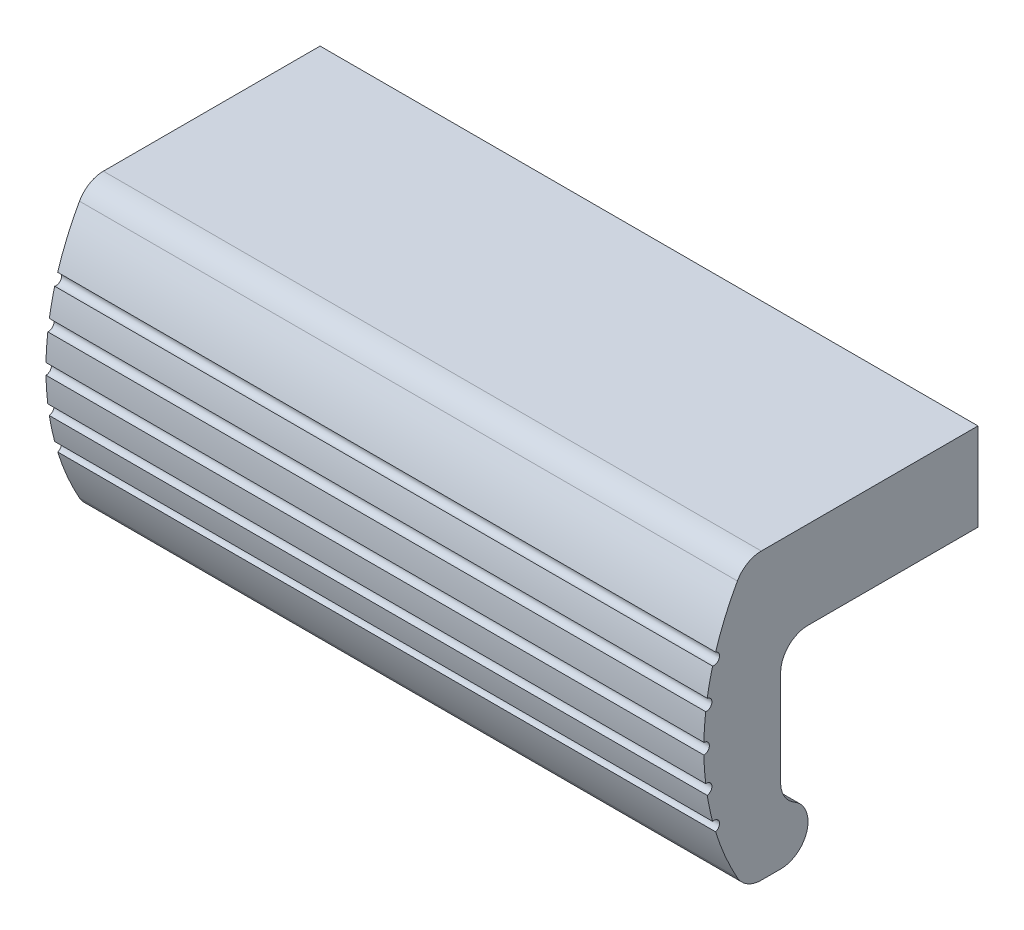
ISO-10303-21;
HEADER;
FILE_DESCRIPTION(('STEP AP214'),'2;1');
FILE_NAME('part.step','',(''),(''),'','','');
FILE_SCHEMA(('AUTOMOTIVE_DESIGN { 1 0 10303 214 1 1 1 1 }'));
ENDSEC;
DATA;
#1=APPLICATION_CONTEXT('core data for automotive mechanical design processes');
#2=APPLICATION_PROTOCOL_DEFINITION('international standard','automotive_design',2000,#1);
#3=PRODUCT_CONTEXT('',#1,'mechanical');
#4=PRODUCT('Part','Part','',(#3));
#5=PRODUCT_RELATED_PRODUCT_CATEGORY('part','',(#4));
#6=PRODUCT_DEFINITION_FORMATION('','',#4);
#7=PRODUCT_DEFINITION_CONTEXT('part definition',#1,'design');
#8=PRODUCT_DEFINITION('design','',#6,#7);
#9=PRODUCT_DEFINITION_SHAPE('','',#8);
#10=(LENGTH_UNIT() NAMED_UNIT(*) SI_UNIT(.MILLI.,.METRE.));
#11=(NAMED_UNIT(*) PLANE_ANGLE_UNIT() SI_UNIT($,.RADIAN.));
#12=(NAMED_UNIT(*) SI_UNIT($,.STERADIAN.) SOLID_ANGLE_UNIT());
#13=UNCERTAINTY_MEASURE_WITH_UNIT(LENGTH_MEASURE(1.E-05),#10,'distance_accuracy_value','');
#14=(GEOMETRIC_REPRESENTATION_CONTEXT(3) GLOBAL_UNCERTAINTY_ASSIGNED_CONTEXT((#13)) GLOBAL_UNIT_ASSIGNED_CONTEXT((#10,
#11,#12)) REPRESENTATION_CONTEXT('',''));
#15=CARTESIAN_POINT('',(0.,0.,0.));
#16=DIRECTION('',(0.,0.,1.));
#17=DIRECTION('',(1.,0.,0.));
#18=AXIS2_PLACEMENT_3D('',#15,#16,#17);
#19=CARTESIAN_POINT('',(-7.5,-4.,0.));
#20=DIRECTION('',(0.,1.,0.));
#21=DIRECTION('',(-1.,0.,0.));
#22=AXIS2_PLACEMENT_3D('',#19,#20,#21);
#23=PLANE('',#22);
#24=DIRECTION('',(1.,0.,0.));
#25=VECTOR('',#24,1.);
#26=CARTESIAN_POINT('',(-7.5,-4.,15.5));
#27=LINE('',#26,#25);
#28=CARTESIAN_POINT('',(-7.5,-4.,15.5));
#29=VERTEX_POINT('',#28);
#30=CARTESIAN_POINT('',(52.5,-4.,15.5));
#31=VERTEX_POINT('',#30);
#32=EDGE_CURVE('E9',#29,#31,#27,.T.);
#33=ORIENTED_EDGE('',*,*,#32,.F.);
#34=DIRECTION('',(0.,0.,1.));
#35=VECTOR('',#34,1.);
#36=CARTESIAN_POINT('',(-7.5,-4.,0.));
#37=LINE('',#36,#35);
#38=CARTESIAN_POINT('',(-7.5,-4.,0.));
#39=VERTEX_POINT('',#38);
#40=EDGE_CURVE('E232',#39,#29,#37,.T.);
#41=ORIENTED_EDGE('',*,*,#40,.F.);
#42=DIRECTION('',(1.,0.,0.));
#43=VECTOR('',#42,1.);
#44=CARTESIAN_POINT('',(-7.5,-4.,0.));
#45=LINE('',#44,#43);
#46=CARTESIAN_POINT('',(52.5,-4.,0.));
#47=VERTEX_POINT('',#46);
#48=EDGE_CURVE('E29',#39,#47,#45,.T.);
#49=ORIENTED_EDGE('',*,*,#48,.T.);
#50=DIRECTION('',(0.,0.,1.));
#51=VECTOR('',#50,1.);
#52=CARTESIAN_POINT('',(52.5,-4.,0.));
#53=LINE('',#52,#51);
#54=EDGE_CURVE('E167',#47,#31,#53,.T.);
#55=ORIENTED_EDGE('',*,*,#54,.T.);
#56=EDGE_LOOP('',(#33,#41,#49,#55));
#57=FACE_BOUND('',#56,.T.);
#58=ADVANCED_FACE('F14',(#57),#23,.F.);
#59=CARTESIAN_POINT('',(-7.5,-6.5,15.5));
#60=DIRECTION('',(1.,0.,0.));
#61=DIRECTION('',(0.,0.,-1.));
#62=AXIS2_PLACEMENT_3D('',#59,#60,#61);
#63=CYLINDRICAL_SURFACE('',#62,2.5);
#64=DIRECTION('',(1.,0.,0.));
#65=VECTOR('',#64,1.);
#66=CARTESIAN_POINT('',(-7.5,-6.5,18.));
#67=LINE('',#66,#65);
#68=CARTESIAN_POINT('',(-7.5,-6.5,18.));
#69=VERTEX_POINT('',#68);
#70=CARTESIAN_POINT('',(52.5,-6.5,18.));
#71=VERTEX_POINT('',#70);
#72=EDGE_CURVE('E22',#69,#71,#67,.T.);
#73=ORIENTED_EDGE('',*,*,#72,.F.);
#74=CARTESIAN_POINT('',(-7.5,-6.5,15.5));
#75=DIRECTION('',(-1.,0.,0.));
#76=DIRECTION('',(0.,0.,1.));
#77=AXIS2_PLACEMENT_3D('',#74,#75,#76);
#78=CIRCLE('',#77,2.5);
#79=EDGE_CURVE('E163',#69,#29,#78,.T.);
#80=ORIENTED_EDGE('',*,*,#79,.T.);
#81=ORIENTED_EDGE('',*,*,#32,.T.);
#82=CARTESIAN_POINT('',(52.5,-6.5,15.5));
#83=DIRECTION('',(-1.,0.,0.));
#84=DIRECTION('',(0.,0.,1.));
#85=AXIS2_PLACEMENT_3D('',#82,#83,#84);
#86=CIRCLE('',#85,2.5);
#87=EDGE_CURVE('E160',#71,#31,#86,.T.);
#88=ORIENTED_EDGE('',*,*,#87,.F.);
#89=EDGE_LOOP('',(#73,#80,#81,#88));
#90=FACE_BOUND('',#89,.T.);
#91=ADVANCED_FACE('F16',(#90),#63,.F.);
#92=CARTESIAN_POINT('',(-7.5,-6.5,18.));
#93=DIRECTION('',(0.,0.,1.));
#94=DIRECTION('',(1.,0.,0.));
#95=AXIS2_PLACEMENT_3D('',#92,#93,#94);
#96=PLANE('',#95);
#97=DIRECTION('',(1.,0.,0.));
#98=VECTOR('',#97,1.);
#99=CARTESIAN_POINT('',(-7.5,-15.1698729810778,18.));
#100=LINE('',#99,#98);
#101=CARTESIAN_POINT('',(-7.5,-15.1698729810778,18.));
#102=VERTEX_POINT('',#101);
#103=CARTESIAN_POINT('',(52.5,-15.1698729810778,18.));
#104=VERTEX_POINT('',#103);
#105=EDGE_CURVE('E324',#102,#104,#100,.T.);
#106=ORIENTED_EDGE('',*,*,#105,.F.);
#107=DIRECTION('',(0.,-1.,0.));
#108=VECTOR('',#107,1.);
#109=CARTESIAN_POINT('',(-7.5,-6.5,18.));
#110=LINE('',#109,#108);
#111=EDGE_CURVE('E235',#69,#102,#110,.T.);
#112=ORIENTED_EDGE('',*,*,#111,.F.);
#113=ORIENTED_EDGE('',*,*,#72,.T.);
#114=DIRECTION('',(0.,-1.,0.));
#115=VECTOR('',#114,1.);
#116=CARTESIAN_POINT('',(52.5,-6.5,18.));
#117=LINE('',#116,#115);
#118=EDGE_CURVE('E175',#71,#104,#117,.T.);
#119=ORIENTED_EDGE('',*,*,#118,.T.);
#120=EDGE_LOOP('',(#106,#112,#113,#119));
#121=FACE_BOUND('',#120,.T.);
#122=ADVANCED_FACE('F327',(#121),#96,.F.);
#123=CARTESIAN_POINT('',(-7.5,-15.1698729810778,15.5));
#124=DIRECTION('',(1.,0.,0.));
#125=DIRECTION('',(0.,0.,-1.));
#126=AXIS2_PLACEMENT_3D('',#123,#124,#125);
#127=CYLINDRICAL_SURFACE('',#126,2.5);
#128=DIRECTION('',(1.,0.,0.));
#129=VECTOR('',#128,1.);
#130=CARTESIAN_POINT('',(-7.5,-17.334936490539,16.75));
#131=LINE('',#130,#129);
#132=CARTESIAN_POINT('',(-7.5,-17.334936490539,16.75));
#133=VERTEX_POINT('',#132);
#134=CARTESIAN_POINT('',(52.5,-17.334936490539,16.75));
#135=VERTEX_POINT('',#134);
#136=EDGE_CURVE('E322',#133,#135,#131,.T.);
#137=ORIENTED_EDGE('',*,*,#136,.F.);
#138=CARTESIAN_POINT('',(-7.5,-15.1698729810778,15.5));
#139=DIRECTION('',(-1.,0.,0.));
#140=DIRECTION('',(0.,0.,1.));
#141=AXIS2_PLACEMENT_3D('',#138,#139,#140);
#142=CIRCLE('',#141,2.5);
#143=EDGE_CURVE('E238',#133,#102,#142,.T.);
#144=ORIENTED_EDGE('',*,*,#143,.T.);
#145=ORIENTED_EDGE('',*,*,#105,.T.);
#146=CARTESIAN_POINT('',(52.5,-15.1698729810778,15.5));
#147=DIRECTION('',(-1.,0.,0.));
#148=DIRECTION('',(0.,0.,1.));
#149=AXIS2_PLACEMENT_3D('',#146,#147,#148);
#150=CIRCLE('',#149,2.5);
#151=EDGE_CURVE('E177',#135,#104,#150,.T.);
#152=ORIENTED_EDGE('',*,*,#151,.F.);
#153=EDGE_LOOP('',(#137,#144,#145,#152));
#154=FACE_BOUND('',#153,.T.);
#155=ADVANCED_FACE('F396',(#154),#127,.F.);
#156=CARTESIAN_POINT('',(-7.5,-19.5,18.));
#157=DIRECTION('',(1.,0.,0.));
#158=DIRECTION('',(0.,0.,-1.));
#159=AXIS2_PLACEMENT_3D('',#156,#157,#158);
#160=CYLINDRICAL_SURFACE('',#159,2.5);
#161=DIRECTION('',(1.,0.,0.));
#162=VECTOR('',#161,1.);
#163=CARTESIAN_POINT('',(-7.5,-22.,18.));
#164=LINE('',#163,#162);
#165=CARTESIAN_POINT('',(-7.5,-22.,18.));
#166=VERTEX_POINT('',#165);
#167=CARTESIAN_POINT('',(52.5,-22.,18.));
#168=VERTEX_POINT('',#167);
#169=EDGE_CURVE('E320',#166,#168,#164,.T.);
#170=ORIENTED_EDGE('',*,*,#169,.F.);
#171=CARTESIAN_POINT('',(-7.5,-19.5,18.));
#172=DIRECTION('',(-1.,0.,0.));
#173=DIRECTION('',(0.,0.,1.));
#174=AXIS2_PLACEMENT_3D('',#171,#172,#173);
#175=CIRCLE('',#174,2.5);
#176=EDGE_CURVE('E241',#133,#166,#175,.T.);
#177=ORIENTED_EDGE('',*,*,#176,.F.);
#178=ORIENTED_EDGE('',*,*,#136,.T.);
#179=CARTESIAN_POINT('',(52.5,-19.5,18.));
#180=DIRECTION('',(-1.,0.,0.));
#181=DIRECTION('',(0.,0.,1.));
#182=AXIS2_PLACEMENT_3D('',#179,#180,#181);
#183=CIRCLE('',#182,2.5);
#184=EDGE_CURVE('E182',#135,#168,#183,.T.);
#185=ORIENTED_EDGE('',*,*,#184,.T.);
#186=EDGE_LOOP('',(#170,#177,#178,#185));
#187=FACE_BOUND('',#186,.T.);
#188=ADVANCED_FACE('F393',(#187),#160,.T.);
#189=CARTESIAN_POINT('',(-7.5,-22.,18.));
#190=DIRECTION('',(0.,1.,0.));
#191=DIRECTION('',(-1.,0.,0.));
#192=AXIS2_PLACEMENT_3D('',#189,#190,#191);
#193=PLANE('',#192);
#194=DIRECTION('',(1.,0.,0.));
#195=VECTOR('',#194,1.);
#196=CARTESIAN_POINT('',(-7.5,-22.,19.7616630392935));
#197=LINE('',#196,#195);
#198=CARTESIAN_POINT('',(-7.5,-22.,19.7616630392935));
#199=VERTEX_POINT('',#198);
#200=CARTESIAN_POINT('',(52.5,-22.,19.7616630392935));
#201=VERTEX_POINT('',#200);
#202=EDGE_CURVE('E318',#199,#201,#197,.T.);
#203=ORIENTED_EDGE('',*,*,#202,.F.);
#204=DIRECTION('',(0.,0.,1.));
#205=VECTOR('',#204,1.);
#206=CARTESIAN_POINT('',(-7.5,-22.,18.));
#207=LINE('',#206,#205);
#208=EDGE_CURVE('E244',#166,#199,#207,.T.);
#209=ORIENTED_EDGE('',*,*,#208,.F.);
#210=ORIENTED_EDGE('',*,*,#169,.T.);
#211=DIRECTION('',(0.,0.,1.));
#212=VECTOR('',#211,1.);
#213=CARTESIAN_POINT('',(52.5,-22.,18.));
#214=LINE('',#213,#212);
#215=EDGE_CURVE('E185',#168,#201,#214,.T.);
#216=ORIENTED_EDGE('',*,*,#215,.T.);
#217=EDGE_LOOP('',(#203,#209,#210,#216));
#218=FACE_BOUND('',#217,.T.);
#219=ADVANCED_FACE('F390',(#218),#193,.F.);
#220=CARTESIAN_POINT('',(-7.5,-19.5,19.7616630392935));
#221=DIRECTION('',(1.,0.,0.));
#222=DIRECTION('',(0.,0.,-1.));
#223=AXIS2_PLACEMENT_3D('',#220,#221,#222);
#224=CYLINDRICAL_SURFACE('',#223,2.5);
#225=DIRECTION('',(1.,0.,0.));
#226=VECTOR('',#225,1.);
#227=CARTESIAN_POINT('',(-7.5,-20.720930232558,21.943251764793));
#228=LINE('',#227,#226);
#229=CARTESIAN_POINT('',(-7.5,-20.720930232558,21.943251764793));
#230=VERTEX_POINT('',#229);
#231=CARTESIAN_POINT('',(52.5,-20.720930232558,21.943251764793));
#232=VERTEX_POINT('',#231);
#233=EDGE_CURVE('E316',#230,#232,#228,.T.);
#234=ORIENTED_EDGE('',*,*,#233,.F.);
#235=CARTESIAN_POINT('',(-7.5,-19.5,19.7616630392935));
#236=DIRECTION('',(-1.,0.,0.));
#237=DIRECTION('',(0.,0.,1.));
#238=AXIS2_PLACEMENT_3D('',#235,#236,#237);
#239=CIRCLE('',#238,2.5);
#240=EDGE_CURVE('E247',#199,#230,#239,.T.);
#241=ORIENTED_EDGE('',*,*,#240,.F.);
#242=ORIENTED_EDGE('',*,*,#202,.T.);
#243=CARTESIAN_POINT('',(52.5,-19.5,19.7616630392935));
#244=DIRECTION('',(-1.,0.,0.));
#245=DIRECTION('',(0.,0.,1.));
#246=AXIS2_PLACEMENT_3D('',#243,#244,#245);
#247=CIRCLE('',#246,2.5);
#248=EDGE_CURVE('E188',#201,#232,#247,.T.);
#249=ORIENTED_EDGE('',*,*,#248,.T.);
#250=EDGE_LOOP('',(#234,#241,#242,#249));
#251=FACE_BOUND('',#250,.T.);
#252=ADVANCED_FACE('F386',(#251),#224,.T.);
#253=CARTESIAN_POINT('',(-7.5,-9.,1.));
#254=DIRECTION('',(1.,0.,0.));
#255=DIRECTION('',(0.,0.,-1.));
#256=AXIS2_PLACEMENT_3D('',#253,#254,#255);
#257=CYLINDRICAL_SURFACE('',#256,24.);
#258=DIRECTION('',(1.,0.,0.));
#259=VECTOR('',#258,1.);
#260=CARTESIAN_POINT('',(-7.5,-16.094465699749,23.9274629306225));
#261=LINE('',#260,#259);
#262=CARTESIAN_POINT('',(-7.5,-16.094465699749,23.9274629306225));
#263=VERTEX_POINT('',#262);
#264=CARTESIAN_POINT('',(52.5,-16.094465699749,23.9274629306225));
#265=VERTEX_POINT('',#264);
#266=EDGE_CURVE('E314',#263,#265,#261,.T.);
#267=ORIENTED_EDGE('',*,*,#266,.F.);
#268=CARTESIAN_POINT('',(-7.5,-9.,1.));
#269=DIRECTION('',(-1.,0.,0.));
#270=DIRECTION('',(0.,0.,1.));
#271=AXIS2_PLACEMENT_3D('',#268,#269,#270);
#272=CIRCLE('',#271,24.);
#273=EDGE_CURVE('E250',#230,#263,#272,.T.);
#274=ORIENTED_EDGE('',*,*,#273,.F.);
#275=ORIENTED_EDGE('',*,*,#233,.T.);
#276=CARTESIAN_POINT('',(52.5,-9.,1.));
#277=DIRECTION('',(-1.,0.,0.));
#278=DIRECTION('',(0.,0.,1.));
#279=AXIS2_PLACEMENT_3D('',#276,#277,#278);
#280=CIRCLE('',#279,24.);
#281=EDGE_CURVE('E191',#232,#265,#280,.T.);
#282=ORIENTED_EDGE('',*,*,#281,.T.);
#283=EDGE_LOOP('',(#267,#274,#275,#282));
#284=FACE_BOUND('',#283,.T.);
#285=ADVANCED_FACE('F381',(#284),#257,.T.);
#286=CARTESIAN_POINT('',(-7.5,-15.615296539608,24.0702807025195));
#287=DIRECTION('',(1.,0.,0.));
#288=DIRECTION('',(0.,0.,-1.));
#289=AXIS2_PLACEMENT_3D('',#286,#287,#288);
#290=CYLINDRICAL_SURFACE('',#289,0.5);
#291=DIRECTION('',(1.,0.,0.));
#292=VECTOR('',#291,1.);
#293=CARTESIAN_POINT('',(-7.5,-15.1332561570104,24.2030853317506));
#294=LINE('',#293,#292);
#295=CARTESIAN_POINT('',(-7.5,-15.1332561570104,24.2030853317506));
#296=VERTEX_POINT('',#295);
#297=CARTESIAN_POINT('',(52.5,-15.1332561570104,24.2030853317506));
#298=VERTEX_POINT('',#297);
#299=EDGE_CURVE('E312',#296,#298,#294,.T.);
#300=ORIENTED_EDGE('',*,*,#299,.F.);
#301=CARTESIAN_POINT('',(-7.5,-15.615296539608,24.0702807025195));
#302=DIRECTION('',(-1.,0.,0.));
#303=DIRECTION('',(0.,0.,1.));
#304=AXIS2_PLACEMENT_3D('',#301,#302,#303);
#305=CIRCLE('',#304,0.5);
#306=EDGE_CURVE('E253',#296,#263,#305,.T.);
#307=ORIENTED_EDGE('',*,*,#306,.T.);
#308=ORIENTED_EDGE('',*,*,#266,.T.);
#309=CARTESIAN_POINT('',(52.5,-15.615296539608,24.0702807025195));
#310=DIRECTION('',(-1.,0.,0.));
#311=DIRECTION('',(0.,0.,1.));
#312=AXIS2_PLACEMENT_3D('',#309,#310,#311);
#313=CIRCLE('',#312,0.5);
#314=EDGE_CURVE('E194',#298,#265,#313,.T.);
#315=ORIENTED_EDGE('',*,*,#314,.F.);
#316=EDGE_LOOP('',(#300,#307,#308,#315));
#317=FACE_BOUND('',#316,.T.);
#318=ADVANCED_FACE('F378',(#317),#290,.F.);
#319=CARTESIAN_POINT('',(-7.5,-9.,1.));
#320=DIRECTION('',(1.,0.,0.));
#321=DIRECTION('',(0.,0.,-1.));
#322=AXIS2_PLACEMENT_3D('',#319,#320,#321);
#323=CYLINDRICAL_SURFACE('',#322,24.);
#324=DIRECTION('',(1.,0.,0.));
#325=VECTOR('',#324,1.);
#326=CARTESIAN_POINT('',(-7.5,-12.8345367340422,24.6916932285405));
#327=LINE('',#326,#325);
#328=CARTESIAN_POINT('',(-7.5,-12.8345367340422,24.6916932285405));
#329=VERTEX_POINT('',#328);
#330=CARTESIAN_POINT('',(52.5,-12.8345367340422,24.6916932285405));
#331=VERTEX_POINT('',#330);
#332=EDGE_CURVE('E310',#329,#331,#327,.T.);
#333=ORIENTED_EDGE('',*,*,#332,.F.);
#334=CARTESIAN_POINT('',(-7.5,-9.,1.));
#335=DIRECTION('',(-1.,0.,0.));
#336=DIRECTION('',(0.,0.,1.));
#337=AXIS2_PLACEMENT_3D('',#334,#335,#336);
#338=CIRCLE('',#337,24.);
#339=EDGE_CURVE('E256',#296,#329,#338,.T.);
#340=ORIENTED_EDGE('',*,*,#339,.F.);
#341=ORIENTED_EDGE('',*,*,#299,.T.);
#342=CARTESIAN_POINT('',(52.5,-9.,1.));
#343=DIRECTION('',(-1.,0.,0.));
#344=DIRECTION('',(0.,0.,1.));
#345=AXIS2_PLACEMENT_3D('',#342,#343,#344);
#346=CIRCLE('',#345,24.);
#347=EDGE_CURVE('E197',#298,#331,#346,.T.);
#348=ORIENTED_EDGE('',*,*,#347,.T.);
#349=EDGE_LOOP('',(#333,#340,#341,#348));
#350=FACE_BOUND('',#349,.T.);
#351=ADVANCED_FACE('F374',(#350),#323,.T.);
#352=CARTESIAN_POINT('',(-7.5,-12.3401544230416,24.7664336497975));
#353=DIRECTION('',(1.,0.,0.));
#354=DIRECTION('',(0.,0.,-1.));
#355=AXIS2_PLACEMENT_3D('',#352,#353,#354);
#356=CYLINDRICAL_SURFACE('',#355,0.5);
#357=DIRECTION('',(1.,0.,0.));
#358=VECTOR('',#357,1.);
#359=CARTESIAN_POINT('',(-7.5,-11.8443223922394,24.830858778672));
#360=LINE('',#359,#358);
#361=CARTESIAN_POINT('',(-7.5,-11.8443223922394,24.830858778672));
#362=VERTEX_POINT('',#361);
#363=CARTESIAN_POINT('',(52.5,-11.8443223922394,24.830858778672));
#364=VERTEX_POINT('',#363);
#365=EDGE_CURVE('E308',#362,#364,#360,.T.);
#366=ORIENTED_EDGE('',*,*,#365,.F.);
#367=CARTESIAN_POINT('',(-7.5,-12.3401544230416,24.7664336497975));
#368=DIRECTION('',(-1.,0.,0.));
#369=DIRECTION('',(0.,0.,1.));
#370=AXIS2_PLACEMENT_3D('',#367,#368,#369);
#371=CIRCLE('',#370,0.5);
#372=EDGE_CURVE('E259',#362,#329,#371,.T.);
#373=ORIENTED_EDGE('',*,*,#372,.T.);
#374=ORIENTED_EDGE('',*,*,#332,.T.);
#375=CARTESIAN_POINT('',(52.5,-12.3401544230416,24.7664336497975));
#376=DIRECTION('',(-1.,0.,0.));
#377=DIRECTION('',(0.,0.,1.));
#378=AXIS2_PLACEMENT_3D('',#375,#376,#377);
#379=CIRCLE('',#378,0.5);
#380=EDGE_CURVE('E200',#364,#331,#379,.T.);
#381=ORIENTED_EDGE('',*,*,#380,.F.);
#382=EDGE_LOOP('',(#366,#373,#374,#381));
#383=FACE_BOUND('',#382,.T.);
#384=ADVANCED_FACE('F369',(#383),#356,.F.);
#385=CARTESIAN_POINT('',(-7.5,-9.,1.));
#386=DIRECTION('',(1.,0.,0.));
#387=DIRECTION('',(0.,0.,-1.));
#388=AXIS2_PLACEMENT_3D('',#385,#386,#387);
#389=CYLINDRICAL_SURFACE('',#388,24.);
#390=DIRECTION('',(1.,0.,0.));
#391=VECTOR('',#390,1.);
#392=CARTESIAN_POINT('',(-7.5,-9.49997287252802,24.9947916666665));
#393=LINE('',#392,#391);
#394=CARTESIAN_POINT('',(-7.5,-9.49997287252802,24.9947916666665));
#395=VERTEX_POINT('',#394);
#396=CARTESIAN_POINT('',(52.5,-9.49997287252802,24.9947916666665));
#397=VERTEX_POINT('',#396);
#398=EDGE_CURVE('E306',#395,#397,#393,.T.);
#399=ORIENTED_EDGE('',*,*,#398,.F.);
#400=CARTESIAN_POINT('',(-7.5,-9.,1.));
#401=DIRECTION('',(-1.,0.,0.));
#402=DIRECTION('',(0.,0.,1.));
#403=AXIS2_PLACEMENT_3D('',#400,#401,#402);
#404=CIRCLE('',#403,24.);
#405=EDGE_CURVE('E262',#362,#395,#404,.T.);
#406=ORIENTED_EDGE('',*,*,#405,.F.);
#407=ORIENTED_EDGE('',*,*,#365,.T.);
#408=CARTESIAN_POINT('',(52.5,-9.,1.));
#409=DIRECTION('',(-1.,0.,0.));
#410=DIRECTION('',(0.,0.,1.));
#411=AXIS2_PLACEMENT_3D('',#408,#409,#410);
#412=CIRCLE('',#411,24.);
#413=EDGE_CURVE('E203',#364,#397,#412,.T.);
#414=ORIENTED_EDGE('',*,*,#413,.T.);
#415=EDGE_LOOP('',(#399,#406,#407,#414));
#416=FACE_BOUND('',#415,.T.);
#417=ADVANCED_FACE('F365',(#416),#389,.T.);
#418=CARTESIAN_POINT('',(-7.5,-9.,25.));
#419=DIRECTION('',(1.,0.,0.));
#420=DIRECTION('',(0.,0.,-1.));
#421=AXIS2_PLACEMENT_3D('',#418,#419,#420);
#422=CYLINDRICAL_SURFACE('',#421,0.500000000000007);
#423=DIRECTION('',(1.,0.,0.));
#424=VECTOR('',#423,1.);
#425=CARTESIAN_POINT('',(-7.5,-8.50002712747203,24.9947916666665));
#426=LINE('',#425,#424);
#427=CARTESIAN_POINT('',(-7.5,-8.50002712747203,24.9947916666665));
#428=VERTEX_POINT('',#427);
#429=CARTESIAN_POINT('',(52.5,-8.50002712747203,24.9947916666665));
#430=VERTEX_POINT('',#429);
#431=EDGE_CURVE('E304',#428,#430,#426,.T.);
#432=ORIENTED_EDGE('',*,*,#431,.F.);
#433=CARTESIAN_POINT('',(-7.5,-9.,25.));
#434=DIRECTION('',(-1.,0.,0.));
#435=DIRECTION('',(0.,0.,1.));
#436=AXIS2_PLACEMENT_3D('',#433,#434,#435);
#437=CIRCLE('',#436,0.500000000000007);
#438=EDGE_CURVE('E265',#428,#395,#437,.T.);
#439=ORIENTED_EDGE('',*,*,#438,.T.);
#440=ORIENTED_EDGE('',*,*,#398,.T.);
#441=CARTESIAN_POINT('',(52.5,-9.,25.));
#442=DIRECTION('',(-1.,0.,0.));
#443=DIRECTION('',(0.,0.,1.));
#444=AXIS2_PLACEMENT_3D('',#441,#442,#443);
#445=CIRCLE('',#444,0.500000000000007);
#446=EDGE_CURVE('E206',#430,#397,#445,.T.);
#447=ORIENTED_EDGE('',*,*,#446,.F.);
#448=EDGE_LOOP('',(#432,#439,#440,#447));
#449=FACE_BOUND('',#448,.T.);
#450=ADVANCED_FACE('F361',(#449),#422,.F.);
#451=CARTESIAN_POINT('',(-7.5,-9.,1.));
#452=DIRECTION('',(1.,0.,0.));
#453=DIRECTION('',(0.,0.,-1.));
#454=AXIS2_PLACEMENT_3D('',#451,#452,#453);
#455=CYLINDRICAL_SURFACE('',#454,24.);
#456=DIRECTION('',(1.,0.,0.));
#457=VECTOR('',#456,1.);
#458=CARTESIAN_POINT('',(-7.5,-6.15567760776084,24.830858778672));
#459=LINE('',#458,#457);
#460=CARTESIAN_POINT('',(-7.5,-6.15567760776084,24.830858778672));
#461=VERTEX_POINT('',#460);
#462=CARTESIAN_POINT('',(52.5,-6.15567760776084,24.830858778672));
#463=VERTEX_POINT('',#462);
#464=EDGE_CURVE('E302',#461,#463,#459,.T.);
#465=ORIENTED_EDGE('',*,*,#464,.F.);
#466=CARTESIAN_POINT('',(-7.5,-9.,1.));
#467=DIRECTION('',(-1.,0.,0.));
#468=DIRECTION('',(0.,0.,1.));
#469=AXIS2_PLACEMENT_3D('',#466,#467,#468);
#470=CIRCLE('',#469,24.);
#471=EDGE_CURVE('E268',#428,#461,#470,.T.);
#472=ORIENTED_EDGE('',*,*,#471,.F.);
#473=ORIENTED_EDGE('',*,*,#431,.T.);
#474=CARTESIAN_POINT('',(52.5,-9.,1.));
#475=DIRECTION('',(-1.,0.,0.));
#476=DIRECTION('',(0.,0.,1.));
#477=AXIS2_PLACEMENT_3D('',#474,#475,#476);
#478=CIRCLE('',#477,24.);
#479=EDGE_CURVE('E209',#430,#463,#478,.T.);
#480=ORIENTED_EDGE('',*,*,#479,.T.);
#481=EDGE_LOOP('',(#465,#472,#473,#480));
#482=FACE_BOUND('',#481,.T.);
#483=ADVANCED_FACE('F357',(#482),#455,.T.);
#484=CARTESIAN_POINT('',(-7.5,-5.65984557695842,24.7664336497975));
#485=DIRECTION('',(1.,0.,0.));
#486=DIRECTION('',(0.,0.,-1.));
#487=AXIS2_PLACEMENT_3D('',#484,#485,#486);
#488=CYLINDRICAL_SURFACE('',#487,0.499999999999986);
#489=DIRECTION('',(1.,0.,0.));
#490=VECTOR('',#489,1.);
#491=CARTESIAN_POINT('',(-7.5,-5.16546326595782,24.6916932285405));
#492=LINE('',#491,#490);
#493=CARTESIAN_POINT('',(-7.5,-5.16546326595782,24.6916932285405));
#494=VERTEX_POINT('',#493);
#495=CARTESIAN_POINT('',(52.5,-5.16546326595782,24.6916932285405));
#496=VERTEX_POINT('',#495);
#497=EDGE_CURVE('E300',#494,#496,#492,.T.);
#498=ORIENTED_EDGE('',*,*,#497,.F.);
#499=CARTESIAN_POINT('',(-7.5,-5.65984557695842,24.7664336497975));
#500=DIRECTION('',(-1.,0.,0.));
#501=DIRECTION('',(0.,0.,1.));
#502=AXIS2_PLACEMENT_3D('',#499,#500,#501);
#503=CIRCLE('',#502,0.499999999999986);
#504=EDGE_CURVE('E271',#494,#461,#503,.T.);
#505=ORIENTED_EDGE('',*,*,#504,.T.);
#506=ORIENTED_EDGE('',*,*,#464,.T.);
#507=CARTESIAN_POINT('',(52.5,-5.65984557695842,24.7664336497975));
#508=DIRECTION('',(-1.,0.,0.));
#509=DIRECTION('',(0.,0.,1.));
#510=AXIS2_PLACEMENT_3D('',#507,#508,#509);
#511=CIRCLE('',#510,0.499999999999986);
#512=EDGE_CURVE('E212',#496,#463,#511,.T.);
#513=ORIENTED_EDGE('',*,*,#512,.F.);
#514=EDGE_LOOP('',(#498,#505,#506,#513));
#515=FACE_BOUND('',#514,.T.);
#516=ADVANCED_FACE('F354',(#515),#488,.F.);
#517=CARTESIAN_POINT('',(-7.5,-9.,1.));
#518=DIRECTION('',(1.,0.,0.));
#519=DIRECTION('',(0.,0.,-1.));
#520=AXIS2_PLACEMENT_3D('',#517,#518,#519);
#521=CYLINDRICAL_SURFACE('',#520,24.);
#522=DIRECTION('',(1.,0.,0.));
#523=VECTOR('',#522,1.);
#524=CARTESIAN_POINT('',(-7.5,-2.8667438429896,24.2030853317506));
#525=LINE('',#524,#523);
#526=CARTESIAN_POINT('',(-7.5,-2.8667438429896,24.2030853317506));
#527=VERTEX_POINT('',#526);
#528=CARTESIAN_POINT('',(52.5,-2.8667438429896,24.2030853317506));
#529=VERTEX_POINT('',#528);
#530=EDGE_CURVE('E298',#527,#529,#525,.T.);
#531=ORIENTED_EDGE('',*,*,#530,.F.);
#532=CARTESIAN_POINT('',(-7.5,-9.,1.));
#533=DIRECTION('',(-1.,0.,0.));
#534=DIRECTION('',(0.,0.,1.));
#535=AXIS2_PLACEMENT_3D('',#532,#533,#534);
#536=CIRCLE('',#535,24.);
#537=EDGE_CURVE('E274',#494,#527,#536,.T.);
#538=ORIENTED_EDGE('',*,*,#537,.F.);
#539=ORIENTED_EDGE('',*,*,#497,.T.);
#540=CARTESIAN_POINT('',(52.5,-9.,1.));
#541=DIRECTION('',(-1.,0.,0.));
#542=DIRECTION('',(0.,0.,1.));
#543=AXIS2_PLACEMENT_3D('',#540,#541,#542);
#544=CIRCLE('',#543,24.);
#545=EDGE_CURVE('E215',#496,#529,#544,.T.);
#546=ORIENTED_EDGE('',*,*,#545,.T.);
#547=EDGE_LOOP('',(#531,#538,#539,#546));
#548=FACE_BOUND('',#547,.T.);
#549=ADVANCED_FACE('F350',(#548),#521,.T.);
#550=CARTESIAN_POINT('',(-7.5,-2.38470346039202,24.0702807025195));
#551=DIRECTION('',(1.,0.,0.));
#552=DIRECTION('',(0.,0.,-1.));
#553=AXIS2_PLACEMENT_3D('',#550,#551,#552);
#554=CYLINDRICAL_SURFACE('',#553,0.500000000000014);
#555=DIRECTION('',(1.,0.,0.));
#556=VECTOR('',#555,1.);
#557=CARTESIAN_POINT('',(-7.5,-1.90553430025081,23.9274629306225));
#558=LINE('',#557,#556);
#559=CARTESIAN_POINT('',(-7.5,-1.90553430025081,23.9274629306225));
#560=VERTEX_POINT('',#559);
#561=CARTESIAN_POINT('',(52.5,-1.90553430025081,23.9274629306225));
#562=VERTEX_POINT('',#561);
#563=EDGE_CURVE('E296',#560,#562,#558,.T.);
#564=ORIENTED_EDGE('',*,*,#563,.F.);
#565=CARTESIAN_POINT('',(-7.5,-2.38470346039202,24.0702807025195));
#566=DIRECTION('',(-1.,0.,0.));
#567=DIRECTION('',(0.,0.,1.));
#568=AXIS2_PLACEMENT_3D('',#565,#566,#567);
#569=CIRCLE('',#568,0.500000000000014);
#570=EDGE_CURVE('E277',#560,#527,#569,.T.);
#571=ORIENTED_EDGE('',*,*,#570,.T.);
#572=ORIENTED_EDGE('',*,*,#530,.T.);
#573=CARTESIAN_POINT('',(52.5,-2.38470346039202,24.0702807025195));
#574=DIRECTION('',(-1.,0.,0.));
#575=DIRECTION('',(0.,0.,1.));
#576=AXIS2_PLACEMENT_3D('',#573,#574,#575);
#577=CIRCLE('',#576,0.500000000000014);
#578=EDGE_CURVE('E218',#562,#529,#577,.T.);
#579=ORIENTED_EDGE('',*,*,#578,.F.);
#580=EDGE_LOOP('',(#564,#571,#572,#579));
#581=FACE_BOUND('',#580,.T.);
#582=ADVANCED_FACE('F345',(#581),#554,.F.);
#583=CARTESIAN_POINT('',(-7.5,-9.,1.));
#584=DIRECTION('',(1.,0.,0.));
#585=DIRECTION('',(0.,0.,-1.));
#586=AXIS2_PLACEMENT_3D('',#583,#584,#585);
#587=CYLINDRICAL_SURFACE('',#586,24.);
#588=DIRECTION('',(1.,0.,0.));
#589=VECTOR('',#588,1.);
#590=CARTESIAN_POINT('',(-7.5,2.72093023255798,21.943251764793));
#591=LINE('',#590,#589);
#592=CARTESIAN_POINT('',(-7.5,2.72093023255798,21.943251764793));
#593=VERTEX_POINT('',#592);
#594=CARTESIAN_POINT('',(52.5,2.72093023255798,21.943251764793));
#595=VERTEX_POINT('',#594);
#596=EDGE_CURVE('E294',#593,#595,#591,.T.);
#597=ORIENTED_EDGE('',*,*,#596,.F.);
#598=CARTESIAN_POINT('',(-7.5,-9.,1.));
#599=DIRECTION('',(-1.,0.,0.));
#600=DIRECTION('',(0.,0.,1.));
#601=AXIS2_PLACEMENT_3D('',#598,#599,#600);
#602=CIRCLE('',#601,24.);
#603=EDGE_CURVE('E280',#560,#593,#602,.T.);
#604=ORIENTED_EDGE('',*,*,#603,.F.);
#605=ORIENTED_EDGE('',*,*,#563,.T.);
#606=CARTESIAN_POINT('',(52.5,-9.,1.));
#607=DIRECTION('',(-1.,0.,0.));
#608=DIRECTION('',(0.,0.,1.));
#609=AXIS2_PLACEMENT_3D('',#606,#607,#608);
#610=CIRCLE('',#609,24.);
#611=EDGE_CURVE('E221',#562,#595,#610,.T.);
#612=ORIENTED_EDGE('',*,*,#611,.T.);
#613=EDGE_LOOP('',(#597,#604,#605,#612));
#614=FACE_BOUND('',#613,.T.);
#615=ADVANCED_FACE('F341',(#614),#587,.T.);
#616=CARTESIAN_POINT('',(-7.5,1.5,19.7616630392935));
#617=DIRECTION('',(1.,0.,0.));
#618=DIRECTION('',(0.,0.,-1.));
#619=AXIS2_PLACEMENT_3D('',#616,#617,#618);
#620=CYLINDRICAL_SURFACE('',#619,2.5);
#621=DIRECTION('',(1.,0.,0.));
#622=VECTOR('',#621,1.);
#623=CARTESIAN_POINT('',(-7.5,4.,19.7616630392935));
#624=LINE('',#623,#622);
#625=CARTESIAN_POINT('',(-7.5,4.,19.7616630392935));
#626=VERTEX_POINT('',#625);
#627=CARTESIAN_POINT('',(52.5,4.,19.7616630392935));
#628=VERTEX_POINT('',#627);
#629=EDGE_CURVE('E292',#626,#628,#624,.T.);
#630=ORIENTED_EDGE('',*,*,#629,.F.);
#631=CARTESIAN_POINT('',(-7.5,1.5,19.7616630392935));
#632=DIRECTION('',(-1.,0.,0.));
#633=DIRECTION('',(0.,0.,1.));
#634=AXIS2_PLACEMENT_3D('',#631,#632,#633);
#635=CIRCLE('',#634,2.5);
#636=EDGE_CURVE('E283',#593,#626,#635,.T.);
#637=ORIENTED_EDGE('',*,*,#636,.F.);
#638=ORIENTED_EDGE('',*,*,#596,.T.);
#639=CARTESIAN_POINT('',(52.5,1.5,19.7616630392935));
#640=DIRECTION('',(-1.,0.,0.));
#641=DIRECTION('',(0.,0.,1.));
#642=AXIS2_PLACEMENT_3D('',#639,#640,#641);
#643=CIRCLE('',#642,2.5);
#644=EDGE_CURVE('E224',#595,#628,#643,.T.);
#645=ORIENTED_EDGE('',*,*,#644,.T.);
#646=EDGE_LOOP('',(#630,#637,#638,#645));
#647=FACE_BOUND('',#646,.T.);
#648=ADVANCED_FACE('F337',(#647),#620,.T.);
#649=CARTESIAN_POINT('',(-7.5,4.,0.));
#650=DIRECTION('',(0.,1.,0.));
#651=DIRECTION('',(-1.,0.,0.));
#652=AXIS2_PLACEMENT_3D('',#649,#650,#651);
#653=PLANE('',#652);
#654=DIRECTION('',(1.,0.,0.));
#655=VECTOR('',#654,1.);
#656=CARTESIAN_POINT('',(-7.5,4.,0.));
#657=LINE('',#656,#655);
#658=CARTESIAN_POINT('',(-7.5,4.,0.));
#659=VERTEX_POINT('',#658);
#660=CARTESIAN_POINT('',(52.5,4.,0.));
#661=VERTEX_POINT('',#660);
#662=EDGE_CURVE('E37',#659,#661,#657,.T.);
#663=ORIENTED_EDGE('',*,*,#662,.F.);
#664=DIRECTION('',(0.,0.,1.));
#665=VECTOR('',#664,1.);
#666=CARTESIAN_POINT('',(-7.5,4.,0.));
#667=LINE('',#666,#665);
#668=EDGE_CURVE('E286',#659,#626,#667,.T.);
#669=ORIENTED_EDGE('',*,*,#668,.T.);
#670=ORIENTED_EDGE('',*,*,#629,.T.);
#671=DIRECTION('',(0.,0.,1.));
#672=VECTOR('',#671,1.);
#673=CARTESIAN_POINT('',(52.5,4.,0.));
#674=LINE('',#673,#672);
#675=EDGE_CURVE('E227',#661,#628,#674,.T.);
#676=ORIENTED_EDGE('',*,*,#675,.F.);
#677=EDGE_LOOP('',(#663,#669,#670,#676));
#678=FACE_BOUND('',#677,.T.);
#679=ADVANCED_FACE('F333',(#678),#653,.T.);
#680=CARTESIAN_POINT('',(-7.5,-4.,0.));
#681=DIRECTION('',(0.,0.,-1.));
#682=DIRECTION('',(-1.,0.,0.));
#683=AXIS2_PLACEMENT_3D('',#680,#681,#682);
#684=PLANE('',#683);
#685=CARTESIAN_POINT('',(0.,0.,0.));
#686=DIRECTION('',(0.,0.,-1.));
#687=DIRECTION('',(-1.,0.,0.));
#688=AXIS2_PLACEMENT_3D('',#685,#686,#687);
#689=CIRCLE('',#688,2.);
#690=CARTESIAN_POINT('',(-2.,0.,0.));
#691=VERTEX_POINT('',#690);
#692=EDGE_CURVE('E632',#691,#691,#689,.T.);
#693=ORIENTED_EDGE('',*,*,#692,.F.);
#694=EDGE_LOOP('',(#693));
#695=FACE_BOUND('',#694,.T.);
#696=CARTESIAN_POINT('',(45.,0.,0.));
#697=DIRECTION('',(0.,0.,-1.));
#698=DIRECTION('',(-1.,0.,0.));
#699=AXIS2_PLACEMENT_3D('',#696,#697,#698);
#700=CIRCLE('',#699,2.);
#701=CARTESIAN_POINT('',(43.,0.,0.));
#702=VERTEX_POINT('',#701);
#703=EDGE_CURVE('E631',#702,#702,#700,.T.);
#704=ORIENTED_EDGE('',*,*,#703,.F.);
#705=EDGE_LOOP('',(#704));
#706=FACE_BOUND('',#705,.T.);
#707=DIRECTION('',(0.,1.,0.));
#708=VECTOR('',#707,1.);
#709=CARTESIAN_POINT('',(-7.5,-4.,0.));
#710=LINE('',#709,#708);
#711=EDGE_CURVE('E288',#39,#659,#710,.T.);
#712=ORIENTED_EDGE('',*,*,#711,.T.);
#713=ORIENTED_EDGE('',*,*,#662,.T.);
#714=DIRECTION('',(0.,1.,0.));
#715=VECTOR('',#714,1.);
#716=CARTESIAN_POINT('',(52.5,-4.,0.));
#717=LINE('',#716,#715);
#718=EDGE_CURVE('E230',#47,#661,#717,.T.);
#719=ORIENTED_EDGE('',*,*,#718,.F.);
#720=ORIENTED_EDGE('',*,*,#48,.F.);
#721=EDGE_LOOP('',(#712,#713,#719,#720));
#722=FACE_BOUND('',#721,.T.);
#723=ADVANCED_FACE('F332',(#695,#706,#722),#684,.T.);
#724=CARTESIAN_POINT('',(-7.5,-6.5,15.5));
#725=DIRECTION('',(-1.,0.,0.));
#726=DIRECTION('',(0.,0.,1.));
#727=AXIS2_PLACEMENT_3D('',#724,#725,#726);
#728=PLANE('',#727);
#729=ORIENTED_EDGE('',*,*,#40,.T.);
#730=ORIENTED_EDGE('',*,*,#79,.F.);
#731=ORIENTED_EDGE('',*,*,#111,.T.);
#732=ORIENTED_EDGE('',*,*,#143,.F.);
#733=ORIENTED_EDGE('',*,*,#176,.T.);
#734=ORIENTED_EDGE('',*,*,#208,.T.);
#735=ORIENTED_EDGE('',*,*,#240,.T.);
#736=ORIENTED_EDGE('',*,*,#273,.T.);
#737=ORIENTED_EDGE('',*,*,#306,.F.);
#738=ORIENTED_EDGE('',*,*,#339,.T.);
#739=ORIENTED_EDGE('',*,*,#372,.F.);
#740=ORIENTED_EDGE('',*,*,#405,.T.);
#741=ORIENTED_EDGE('',*,*,#438,.F.);
#742=ORIENTED_EDGE('',*,*,#471,.T.);
#743=ORIENTED_EDGE('',*,*,#504,.F.);
#744=ORIENTED_EDGE('',*,*,#537,.T.);
#745=ORIENTED_EDGE('',*,*,#570,.F.);
#746=ORIENTED_EDGE('',*,*,#603,.T.);
#747=ORIENTED_EDGE('',*,*,#636,.T.);
#748=ORIENTED_EDGE('',*,*,#668,.F.);
#749=ORIENTED_EDGE('',*,*,#711,.F.);
#750=EDGE_LOOP('',(#729,#730,#731,#732,#733,#734,#735,#736,#737,#738,#739,#740,#741,#742,#743,
#744,#745,#746,#747,#748,#749));
#751=FACE_BOUND('',#750,.T.);
#752=ADVANCED_FACE('F329',(#751),#728,.T.);
#753=CARTESIAN_POINT('',(52.5,-6.5,15.5));
#754=DIRECTION('',(-1.,0.,0.));
#755=DIRECTION('',(0.,0.,1.));
#756=AXIS2_PLACEMENT_3D('',#753,#754,#755);
#757=PLANE('',#756);
#758=ORIENTED_EDGE('',*,*,#54,.F.);
#759=ORIENTED_EDGE('',*,*,#718,.T.);
#760=ORIENTED_EDGE('',*,*,#675,.T.);
#761=ORIENTED_EDGE('',*,*,#644,.F.);
#762=ORIENTED_EDGE('',*,*,#611,.F.);
#763=ORIENTED_EDGE('',*,*,#578,.T.);
#764=ORIENTED_EDGE('',*,*,#545,.F.);
#765=ORIENTED_EDGE('',*,*,#512,.T.);
#766=ORIENTED_EDGE('',*,*,#479,.F.);
#767=ORIENTED_EDGE('',*,*,#446,.T.);
#768=ORIENTED_EDGE('',*,*,#413,.F.);
#769=ORIENTED_EDGE('',*,*,#380,.T.);
#770=ORIENTED_EDGE('',*,*,#347,.F.);
#771=ORIENTED_EDGE('',*,*,#314,.T.);
#772=ORIENTED_EDGE('',*,*,#281,.F.);
#773=ORIENTED_EDGE('',*,*,#248,.F.);
#774=ORIENTED_EDGE('',*,*,#215,.F.);
#775=ORIENTED_EDGE('',*,*,#184,.F.);
#776=ORIENTED_EDGE('',*,*,#151,.T.);
#777=ORIENTED_EDGE('',*,*,#118,.F.);
#778=ORIENTED_EDGE('',*,*,#87,.T.);
#779=EDGE_LOOP('',(#758,#759,#760,#761,#762,#763,#764,#765,#766,#767,#768,#769,#770,#771,#772,
#773,#774,#775,#776,#777,#778));
#780=FACE_BOUND('',#779,.T.);
#781=ADVANCED_FACE('F172',(#780),#757,.F.);
#782=CARTESIAN_POINT('',(45.,0.,8.));
#783=DIRECTION('',(0.,0.,-1.));
#784=DIRECTION('',(-1.,0.,0.));
#785=AXIS2_PLACEMENT_3D('',#782,#783,#784);
#786=CYLINDRICAL_SURFACE('',#785,2.);
#787=CARTESIAN_POINT('',(45.,0.,8.));
#788=DIRECTION('',(0.,0.,-1.));
#789=DIRECTION('',(-1.,0.,0.));
#790=AXIS2_PLACEMENT_3D('',#787,#788,#789);
#791=CIRCLE('',#790,2.);
#792=CARTESIAN_POINT('',(43.,0.,8.));
#793=VERTEX_POINT('',#792);
#794=EDGE_CURVE('E170',#793,#793,#791,.T.);
#795=ORIENTED_EDGE('',*,*,#794,.F.);
#796=EDGE_LOOP('',(#795));
#797=FACE_BOUND('',#796,.T.);
#798=ORIENTED_EDGE('',*,*,#703,.T.);
#799=EDGE_LOOP('',(#798));
#800=FACE_BOUND('',#799,.T.);
#801=ADVANCED_FACE('F545',(#797,#800),#786,.F.);
#802=CARTESIAN_POINT('',(45.,0.,8.));
#803=DIRECTION('',(0.,0.,-1.));
#804=DIRECTION('',(-1.,0.,0.));
#805=AXIS2_PLACEMENT_3D('',#802,#803,#804);
#806=PLANE('',#805);
#807=ORIENTED_EDGE('',*,*,#794,.T.);
#808=EDGE_LOOP('',(#807));
#809=FACE_BOUND('',#808,.T.);
#810=ADVANCED_FACE('F546',(#809),#806,.T.);
#811=CARTESIAN_POINT('',(0.,0.,8.));
#812=DIRECTION('',(0.,0.,-1.));
#813=DIRECTION('',(-1.,0.,0.));
#814=AXIS2_PLACEMENT_3D('',#811,#812,#813);
#815=CYLINDRICAL_SURFACE('',#814,2.);
#816=CARTESIAN_POINT('',(0.,0.,8.));
#817=DIRECTION('',(0.,0.,-1.));
#818=DIRECTION('',(-1.,0.,0.));
#819=AXIS2_PLACEMENT_3D('',#816,#817,#818);
#820=CIRCLE('',#819,2.);
#821=CARTESIAN_POINT('',(-2.,0.,8.));
#822=VERTEX_POINT('',#821);
#823=EDGE_CURVE('E630',#822,#822,#820,.T.);
#824=ORIENTED_EDGE('',*,*,#823,.F.);
#825=EDGE_LOOP('',(#824));
#826=FACE_BOUND('',#825,.T.);
#827=ORIENTED_EDGE('',*,*,#692,.T.);
#828=EDGE_LOOP('',(#827));
#829=FACE_BOUND('',#828,.T.);
#830=ADVANCED_FACE('F562',(#826,#829),#815,.F.);
#831=CARTESIAN_POINT('',(0.,0.,8.));
#832=DIRECTION('',(0.,0.,-1.));
#833=DIRECTION('',(-1.,0.,0.));
#834=AXIS2_PLACEMENT_3D('',#831,#832,#833);
#835=PLANE('',#834);
#836=ORIENTED_EDGE('',*,*,#823,.T.);
#837=EDGE_LOOP('',(#836));
#838=FACE_BOUND('',#837,.T.);
#839=ADVANCED_FACE('F555',(#838),#835,.T.);
#840=CLOSED_SHELL('',(#58,#91,#122,#155,#188,#219,#252,#285,#318,#351,#384,#417,#450,#483,#516,
#549,#582,#615,#648,#679,#723,#752,#781,#801,#810,#830,#839));
#841=MANIFOLD_SOLID_BREP('B1',#840);
#842=ADVANCED_BREP_SHAPE_REPRESENTATION('',(#18,#841),#14);
#843=SHAPE_DEFINITION_REPRESENTATION(#9,#842);
ENDSEC;
END-ISO-10303-21;
